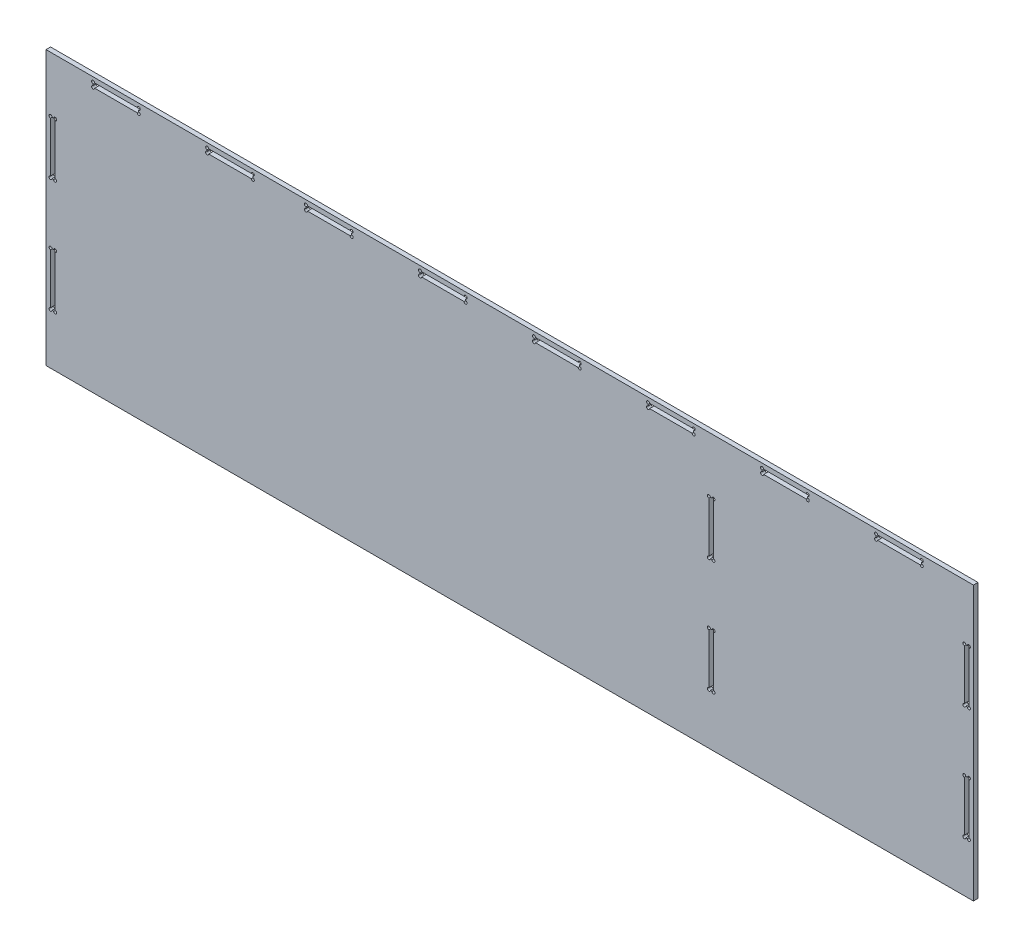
from build123d import *

# Parameters (mm, degrees)
SKETCH1_W           = 1220
SKETCH1_H           = 360
BOSS_EXTRUDE1_DEPTH = 6


with BuildPart() as part:
    # Sketch1 → Boss-Extrude1 (new body)
    with BuildSketch(Plane.XY):
        Rectangle(SKETCH1_W, SKETCH1_H)
        with BuildLine():
            ThreePointArc((-604, -45), (-605.414213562, -41.585786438), (-602, -43))
            Line((-602, -43), (-600, -43))
            ThreePointArc((-600, -43), (-598, -41), (-596, -43))
            ThreePointArc((-596, -43), (-596.585786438, -44.414213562), (-598, -45))
            Line((-598, -45), (-598, -111))
            ThreePointArc((-598, -111), (-596.585786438, -111.585786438), (-596, -113))
            ThreePointArc((-596, -113), (-598, -115), (-600, -113))
            Line((-600, -113), (-602, -113))
            ThreePointArc((-602, -113), (-605.414213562, -114.414213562), (-604, -111))
            Line((-604, -111), (-604, -45))
        make_face(mode=Mode.SUBTRACT)
        with BuildLine():
            Line((266, -113), (264, -113))
            ThreePointArc((264, -113), (260.585786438, -114.414213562), (262, -111))
            Line((262, -111), (262, -45))
            ThreePointArc((262, -45), (260.585786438, -41.585786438), (264, -43))
            Line((264, -43), (266, -43))
            ThreePointArc((266, -43), (268, -41), (270, -43))
            ThreePointArc((270, -43), (269.414213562, -44.414213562), (268, -45))
            Line((268, -45), (268, -111))
            ThreePointArc((268, -111), (269.414213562, -111.585786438), (270, -113))
            ThreePointArc((270, -113), (268, -115), (266, -113))
        make_face(mode=Mode.SUBTRACT)
        with BuildLine():
            Line((602, -113), (600, -113))
            ThreePointArc((600, -113), (596.585786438, -114.414213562), (598, -111))
            Line((598, -111), (598, -45))
            ThreePointArc((598, -45), (596.585786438, -41.585786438), (600, -43))
            Line((600, -43), (602, -43))
            ThreePointArc((602, -43), (604, -41), (606, -43))
            ThreePointArc((606, -43), (605.414213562, -44.414213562), (604, -45))
            Line((604, -45), (604, -111))
            ThreePointArc((604, -111), (605.414213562, -111.585786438), (606, -113))
            ThreePointArc((606, -113), (604, -115), (602, -113))
        make_face(mode=Mode.SUBTRACT)
        with BuildLine():
            ThreePointArc((-604, 105), (-605.414213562, 108.414213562), (-602, 107))
            Line((-602, 107), (-600, 107))
            ThreePointArc((-600, 107), (-598, 109), (-596, 107))
            ThreePointArc((-596, 107), (-596.585786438, 105.585786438), (-598, 105))
            Line((-598, 105), (-598, 39))
            ThreePointArc((-598, 39), (-596.585786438, 38.414213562), (-596, 37))
            ThreePointArc((-596, 37), (-598, 35), (-600, 37))
            Line((-600, 37), (-602, 37))
            ThreePointArc((-602, 37), (-605.414213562, 35.585786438), (-604, 39))
            Line((-604, 39), (-604, 105))
        make_face(mode=Mode.SUBTRACT)
        with BuildLine():
            ThreePointArc((-548, 172), (-549.414213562, 175.414213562), (-546, 174))
            Line((-546, 174), (-490, 174))
            ThreePointArc((-490, 174), (-488, 176), (-486, 174))
            ThreePointArc((-486, 174), (-486.585786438, 172.585786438), (-488, 172))
            Line((-488, 172), (-488, 170))
            ThreePointArc((-488, 170), (-486.585786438, 169.414213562), (-486, 168))
            ThreePointArc((-486, 168), (-488, 166), (-490, 168))
            Line((-490, 168), (-546, 168))
            ThreePointArc((-546, 168), (-549.414213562, 166.585786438), (-548, 170))
            Line((-548, 170), (-548, 172))
        make_face(mode=Mode.SUBTRACT)
        with BuildLine():
            ThreePointArc((-398, 172), (-399.414213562, 175.414213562), (-396, 174))
            Line((-396, 174), (-340, 174))
            ThreePointArc((-340, 174), (-338, 176), (-336, 174))
            ThreePointArc((-336, 174), (-336.585786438, 172.585786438), (-338, 172))
            Line((-338, 172), (-338, 170))
            ThreePointArc((-338, 170), (-336.585786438, 169.414213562), (-336, 168))
            ThreePointArc((-336, 168), (-338, 166), (-340, 168))
            Line((-340, 168), (-396, 168))
            ThreePointArc((-396, 168), (-399.414213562, 166.585786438), (-398, 170))
            Line((-398, 170), (-398, 172))
        make_face(mode=Mode.SUBTRACT)
        with BuildLine():
            ThreePointArc((-268, 172), (-269.414213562, 175.414213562), (-266, 174))
            Line((-266, 174), (-210, 174))
            ThreePointArc((-210, 174), (-208, 176), (-206, 174))
            ThreePointArc((-206, 174), (-206.585786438, 172.585786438), (-208, 172))
            Line((-208, 172), (-208, 170))
            ThreePointArc((-208, 170), (-206.585786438, 169.414213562), (-206, 168))
            ThreePointArc((-206, 168), (-208, 166), (-210, 168))
            Line((-210, 168), (-266, 168))
            ThreePointArc((-266, 168), (-269.414213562, 166.585786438), (-268, 170))
            Line((-268, 170), (-268, 172))
        make_face(mode=Mode.SUBTRACT)
        with BuildLine():
            ThreePointArc((-118, 172), (-119.414213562, 175.414213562), (-116, 174))
            Line((-116, 174), (-60, 174))
            ThreePointArc((-60, 174), (-58, 176), (-56, 174))
            ThreePointArc((-56, 174), (-56.585786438, 172.585786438), (-58, 172))
            Line((-58, 172), (-58, 170))
            ThreePointArc((-58, 170), (-56.585786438, 169.414213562), (-56, 168))
            ThreePointArc((-56, 168), (-58, 166), (-60, 168))
            Line((-60, 168), (-116, 168))
            ThreePointArc((-116, 168), (-119.414213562, 166.585786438), (-118, 170))
            Line((-118, 170), (-118, 172))
        make_face(mode=Mode.SUBTRACT)
        with BuildLine():
            Line((266, 37), (264, 37))
            ThreePointArc((264, 37), (260.585786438, 35.585786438), (262, 39))
            Line((262, 39), (262, 105))
            ThreePointArc((262, 105), (260.585786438, 108.414213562), (264, 107))
            Line((264, 107), (266, 107))
            ThreePointArc((266, 107), (268, 109), (270, 107))
            ThreePointArc((270, 107), (269.414213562, 105.585786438), (268, 105))
            Line((268, 105), (268, 39))
            ThreePointArc((268, 39), (269.414213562, 38.414213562), (270, 37))
            ThreePointArc((270, 37), (268, 35), (266, 37))
        make_face(mode=Mode.SUBTRACT)
        with BuildLine():
            Line((602, 37), (600, 37))
            ThreePointArc((600, 37), (596.585786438, 35.585786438), (598, 39))
            Line((598, 39), (598, 105))
            ThreePointArc((598, 105), (596.585786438, 108.414213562), (600, 107))
            Line((600, 107), (602, 107))
            ThreePointArc((602, 107), (604, 109), (606, 107))
            ThreePointArc((606, 107), (605.414213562, 105.585786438), (604, 105))
            Line((604, 105), (604, 39))
            ThreePointArc((604, 39), (605.414213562, 38.414213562), (606, 37))
            ThreePointArc((606, 37), (604, 35), (602, 37))
        make_face(mode=Mode.SUBTRACT)
        with BuildLine():
            ThreePointArc((32, 172), (30.585786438, 175.414213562), (34, 174))
            Line((34, 174), (90, 174))
            ThreePointArc((90, 174), (92, 176), (94, 174))
            ThreePointArc((94, 174), (93.414213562, 172.585786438), (92, 172))
            Line((92, 172), (92, 170))
            ThreePointArc((92, 170), (93.414213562, 169.414213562), (94, 168))
            ThreePointArc((94, 168), (92, 166), (90, 168))
            Line((90, 168), (34, 168))
            ThreePointArc((34, 168), (30.585786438, 166.585786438), (32, 170))
            Line((32, 170), (32, 172))
        make_face(mode=Mode.SUBTRACT)
        with BuildLine():
            ThreePointArc((182, 172), (180.585786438, 175.414213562), (184, 174))
            Line((184, 174), (240, 174))
            ThreePointArc((240, 174), (242, 176), (244, 174))
            ThreePointArc((244, 174), (243.414213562, 172.585786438), (242, 172))
            Line((242, 172), (242, 170))
            ThreePointArc((242, 170), (243.414213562, 169.414213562), (244, 168))
            ThreePointArc((244, 168), (242, 166), (240, 168))
            Line((240, 168), (184, 168))
            ThreePointArc((184, 168), (180.585786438, 166.585786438), (182, 170))
            Line((182, 170), (182, 172))
        make_face(mode=Mode.SUBTRACT)
        with BuildLine():
            ThreePointArc((332, 172), (330.585786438, 175.414213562), (334, 174))
            Line((334, 174), (390, 174))
            ThreePointArc((390, 174), (392, 176), (394, 174))
            ThreePointArc((394, 174), (393.414213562, 172.585786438), (392, 172))
            Line((392, 172), (392, 170))
            ThreePointArc((392, 170), (393.414213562, 169.414213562), (394, 168))
            ThreePointArc((394, 168), (392, 166), (390, 168))
            Line((390, 168), (334, 168))
            ThreePointArc((334, 168), (330.585786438, 166.585786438), (332, 170))
            Line((332, 170), (332, 172))
        make_face(mode=Mode.SUBTRACT)
        with BuildLine():
            ThreePointArc((482, 172), (480.585786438, 175.414213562), (484, 174))
            Line((484, 174), (540, 174))
            ThreePointArc((540, 174), (542, 176), (544, 174))
            ThreePointArc((544, 174), (543.414213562, 172.585786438), (542, 172))
            Line((542, 172), (542, 170))
            ThreePointArc((542, 170), (543.414213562, 169.414213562), (544, 168))
            ThreePointArc((544, 168), (542, 166), (540, 168))
            Line((540, 168), (484, 168))
            ThreePointArc((484, 168), (480.585786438, 166.585786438), (482, 170))
            Line((482, 170), (482, 172))
        make_face(mode=Mode.SUBTRACT)
    extrude(amount=BOSS_EXTRUDE1_DEPTH)


solid = part.part
